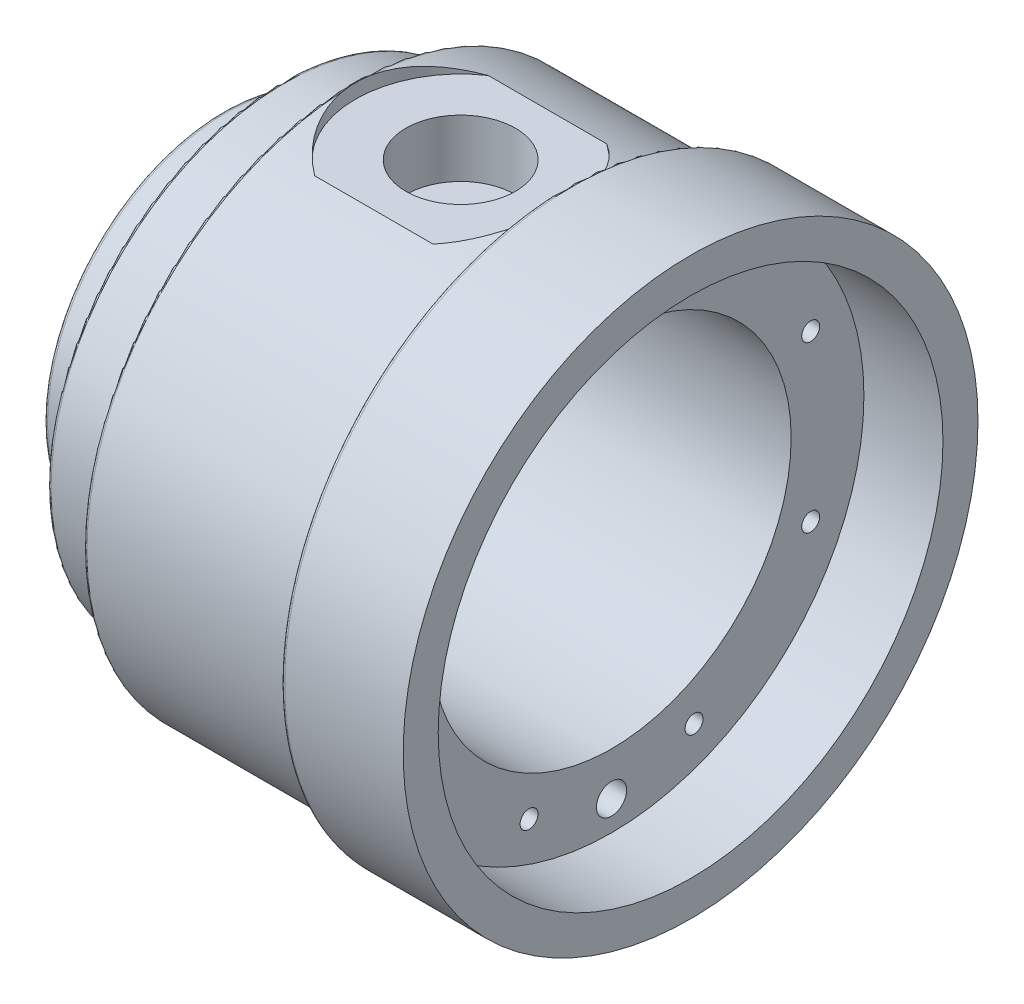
from build123d import *

# Parameters (mm, degrees)
SKETCH27_R                 = 40
BOSS_EXTRUDE2_DEPTH        = 17
SKETCH28_R                 = 37.5
BOSS_EXTRUDE3_DEPTH        = 30
SKETCH29_R                 = 32.5
BOSS_EXTRUDE4_DEPTH        = 10
SKETCH30_R                 = 25
BOSS_EXTRUDE5_DEPTH        = 8
SKETCH31_R                 = 35.125
CUT_EXTRUDE11_DEPTH        = 11
SKETCH32_R                 = 25
CUT_EXTRUDE12_DEPTH        = 41
SKETCH33_R                 = 17.6
CUT_EXTRUDE13_DEPTH        = 0.8
SKETCH34_R                 = 2.75
CUT_EXTRUDE14_DEPTH        = 5
SKETCH35_R                 = 5
CUT_EXTRUDE15_DEPTH        = 81.875459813
CIRPATTERN6_COUNT          = 2
CUT_EXTRUDE16_DEPTH        = 8
FILLET2_R                  = 0.5
SKETCH40_R                 = 14.625
CUT_EXTRUDE17_DEPTH        = 2
SKETCH41_R                 = 7.625
CUT_EXTRUDE18_DEPTH        = 8
CUT_EXTRUDE19_START        = -2
SKETCH42_R                 = 14.625
CUT_EXTRUDE19_DEPTH        = 2
CUT_EXTRUDE20_START        = -8
SKETCH43_R                 = 7.625
CUT_EXTRUDE20_DEPTH        = 8
M5X0_8_TAPPED_HOLE1_REACH  = 80.205
M5X0_8_TAPPED_HOLE1_BORE_R = 2.1
CIRPATTERN7_COUNT          = 8


with BuildPart() as part:
    # Sketch27 → Boss-Extrude2 (new body)
    with BuildSketch(Plane(origin=(0, 0, 0), x_dir=(0, 0, -1), z_dir=(1, 0, 0))):
        Circle(SKETCH27_R)
    extrude(amount=-BOSS_EXTRUDE2_DEPTH)

    # Sketch28 → Boss-Extrude3 (add)
    with BuildSketch(Plane.ZY.offset(17)):
        with Locations(Location((0, 0, 0), (0, 0, 180))):
            Circle(SKETCH28_R)
    extrude(amount=BOSS_EXTRUDE3_DEPTH)

    # Sketch29 → Boss-Extrude4 (add)
    with BuildSketch(Plane.ZY.offset(47)):
        Circle(SKETCH29_R)
    extrude(amount=BOSS_EXTRUDE4_DEPTH)

    # Sketch30 → Boss-Extrude5 (add)
    with BuildSketch(Plane.ZY.offset(57)):
        Circle(SKETCH30_R)
    extrude(amount=BOSS_EXTRUDE5_DEPTH)

    # Sketch31 → Cut-Extrude11 (cut)
    with BuildSketch(Plane(origin=(0, 0, 0), x_dir=(0, 0, -1), z_dir=(1, 0, 0))):
        Circle(SKETCH31_R)
    extrude(amount=-CUT_EXTRUDE11_DEPTH, mode=Mode.SUBTRACT)

    # Sketch32 → Cut-Extrude12 (cut)
    with BuildSketch(Plane(origin=(-11, 0, 0), x_dir=(0, 0, -1), z_dir=(1, 0, 0))):
        with Locations(Location((0, 0, 0), (0, 0, 180))):
            Circle(SKETCH32_R)
    extrude(amount=-CUT_EXTRUDE12_DEPTH, mode=Mode.SUBTRACT)

    # Sketch33 → Cut-Extrude13 (cut)
    with BuildSketch(Plane(origin=(-52, 0, 0), x_dir=(0, 0, -1), z_dir=(1, 0, 0))):
        Circle(SKETCH33_R)
    extrude(amount=-CUT_EXTRUDE13_DEPTH, mode=Mode.SUBTRACT)

    # Sketch34 → Cut-Extrude14 (cut)
    with BuildSketch(Plane(origin=(-52.8, 0, 0), x_dir=(0, 0, -1), z_dir=(1, 0, 0))):
        with Locations((0, 12.495)):
            Circle(SKETCH34_R)
    cut_extrude14 = extrude(amount=-CUT_EXTRUDE14_DEPTH, mode=Mode.SUBTRACT)

    # Sketch35 → Cut-Extrude15 (cut, through all)
    with BuildSketch(Plane(origin=(-57.8, 0, 0), x_dir=(0, 0, -1), z_dir=(1, 0, 0))):
        with Locations((0, 12.495)):
            Circle(SKETCH35_R)
    cut_extrude15 = extrude(amount=-CUT_EXTRUDE15_DEPTH, mode=Mode.SUBTRACT)

    # CirPattern6: Cut-Extrude14, Cut-Extrude15 ×2 about axis
    cirpattern6_axis = Axis((0, 0, 0), (1, 0, 0))
    add([cut_extrude14.rotate(cirpattern6_axis, i * 360 / CIRPATTERN6_COUNT) for i in range(1, CIRPATTERN6_COUNT)], mode=Mode.SUBTRACT)
    add([cut_extrude15.rotate(cirpattern6_axis, i * 360 / CIRPATTERN6_COUNT) for i in range(1, CIRPATTERN6_COUNT)], mode=Mode.SUBTRACT)

    # Sketch36 → Cut-Extrude16 (cut)
    with BuildSketch(Plane(origin=(-52, 0, 0), x_dir=(0, 0, -1), z_dir=(1, 0, 0))):
        with BuildLine():
            Line((-17.5, 5), (17.5, 5))
            ThreePointArc((17.5, 5), (22.5, 0), (17.5, -5))
            Line((17.5, -5), (-17.5, -5))
            ThreePointArc((-17.5, -5), (-22.5, 0), (-17.5, 5))
        make_face()
    extrude(amount=-CUT_EXTRUDE16_DEPTH, mode=Mode.SUBTRACT)

    # Fillet2
    fillet2_edges = [part.edges().sort_by_distance(p)[0] for p in [
        (-57, 0, -32.5),
        (-65, 0, -25),
        (-17, 0, 40),
        (-47, 0, 37.5),
    ]]
    fillet(fillet2_edges, radius=FILLET2_R)

    # Sketch40 → Cut-Extrude17 (cut)
    with BuildSketch(Plane(origin=(0, 37.5, 0), x_dir=(-1, 0, 0), z_dir=(0, 1, 0))):
        with Locations((32, 0)):
            Circle(SKETCH40_R)
    extrude(amount=-CUT_EXTRUDE17_DEPTH, mode=Mode.SUBTRACT)

    # Sketch41 → Cut-Extrude18 (cut)
    with BuildSketch(Plane(origin=(0, 35.5, 0), x_dir=(1, 0, 0), z_dir=(0, 1, 0))):
        with Locations(Location((-32, 0, 0), (0, 0, 270))):
            Circle(SKETCH41_R)
    extrude(amount=-CUT_EXTRUDE18_DEPTH, mode=Mode.SUBTRACT)

    # Sketch42 → Cut-Extrude19 (cut)
    with BuildSketch(Plane.XZ.offset(37.5).offset(CUT_EXTRUDE19_START)):
        with Locations((-32, 0)):
            Circle(SKETCH42_R)
    extrude(amount=CUT_EXTRUDE19_DEPTH, mode=Mode.SUBTRACT)

    # Sketch43 → Cut-Extrude20 (cut)
    with BuildSketch(Plane.XZ.offset(35.5).offset(CUT_EXTRUDE20_START)):
        with Locations(Location((-32, 0, 0), (0, 0, 90))):
            Circle(SKETCH43_R)
    extrude(amount=CUT_EXTRUDE20_DEPTH, mode=Mode.SUBTRACT)

    # M5x0.8 Tapped Hole1 bore → M5x0.8 Tapped Hole1 (cut, up to next)
    with BuildSketch(Plane(origin=(-11, 0, 0), x_dir=(0, 0, -1), z_dir=(1, 0, 0)), mode=Mode.PRIVATE) as m5x0_8_tapped_hole1_sk1:
        with Locations((0, 31)):
            Circle(M5X0_8_TAPPED_HOLE1_BORE_R)
    m5x0_8_tapped_hole1_tool1 = extrude(m5x0_8_tapped_hole1_sk1.sketch, amount=-M5X0_8_TAPPED_HOLE1_REACH, mode=Mode.PRIVATE) & part.part
    # M5x0.8 Tapped Hole1 bore → M5x0.8 Tapped Hole1 (cut, up to next)
    with BuildSketch(Plane(origin=(-11, 0, 0), x_dir=(0, 0, -1), z_dir=(1, 0, 0)), mode=Mode.PRIVATE) as m5x0_8_tapped_hole1_sk2:
        with Locations((0, -31)):
            Circle(M5X0_8_TAPPED_HOLE1_BORE_R)
    m5x0_8_tapped_hole1_tool2 = extrude(m5x0_8_tapped_hole1_sk2.sketch, amount=-M5X0_8_TAPPED_HOLE1_REACH, mode=Mode.PRIVATE) & part.part
    add(m5x0_8_tapped_hole1_tool1.solids().sort_by_distance((-11, 31, 0))[0], mode=Mode.SUBTRACT)
    add(m5x0_8_tapped_hole1_tool2.solids().sort_by_distance((-11, -31, 0))[0], mode=Mode.SUBTRACT)

    # Sketch47 → M3x0.5 Tapped Hole1 (revolve, cut)
    with BuildSketch(Plane(origin=(-11, 27.716387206, -11.4805), x_dir=(0, 0, -1), z_dir=(0, 1, 0))):
        Polygon((0, 0), (0, 13.251075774), (1.25, 12.5), (1.25, 0), align=None)
    m3x0_5_tapped_hole1 = revolve(axis=Axis((-4.65, 27.716387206, -11.4805), (-1, 0, 0)), mode=Mode.SUBTRACT)

    # CirPattern7: M3x0.5 Tapped Hole1 ×8 about axis
    cirpattern7_axis = Axis((0, 0, 0), (1, 0, 0))
    for i in range(1, CIRPATTERN7_COUNT):
        add(m3x0_5_tapped_hole1.rotate(cirpattern7_axis, i * 360 / CIRPATTERN7_COUNT), mode=Mode.SUBTRACT)


solid = part.part
